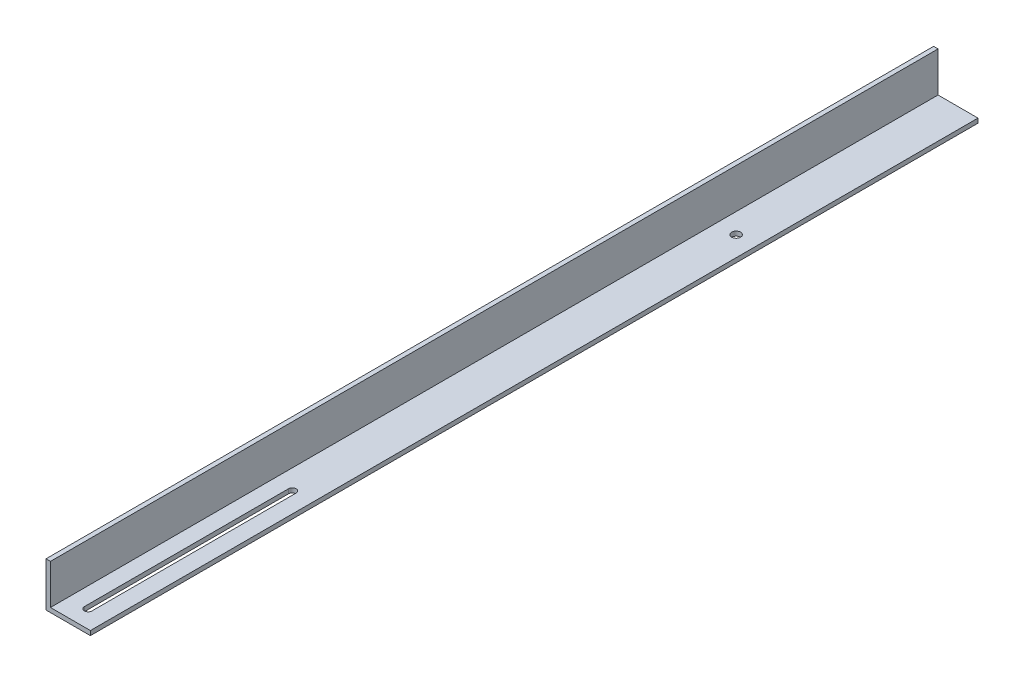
ISO-10303-21;
HEADER;
FILE_DESCRIPTION(('STEP AP214'),'2;1');
FILE_NAME('part.step','',(''),(''),'','','');
FILE_SCHEMA(('AUTOMOTIVE_DESIGN { 1 0 10303 214 1 1 1 1 }'));
ENDSEC;
DATA;
#1=APPLICATION_CONTEXT('core data for automotive mechanical design processes');
#2=APPLICATION_PROTOCOL_DEFINITION('international standard','automotive_design',2000,#1);
#3=PRODUCT_CONTEXT('',#1,'mechanical');
#4=PRODUCT('Part','Part','',(#3));
#5=PRODUCT_RELATED_PRODUCT_CATEGORY('part','',(#4));
#6=PRODUCT_DEFINITION_FORMATION('','',#4);
#7=PRODUCT_DEFINITION_CONTEXT('part definition',#1,'design');
#8=PRODUCT_DEFINITION('design','',#6,#7);
#9=PRODUCT_DEFINITION_SHAPE('','',#8);
#10=(LENGTH_UNIT() NAMED_UNIT(*) SI_UNIT(.MILLI.,.METRE.));
#11=(NAMED_UNIT(*) PLANE_ANGLE_UNIT() SI_UNIT($,.RADIAN.));
#12=(NAMED_UNIT(*) SI_UNIT($,.STERADIAN.) SOLID_ANGLE_UNIT());
#13=UNCERTAINTY_MEASURE_WITH_UNIT(LENGTH_MEASURE(1.E-05),#10,'distance_accuracy_value','');
#14=(GEOMETRIC_REPRESENTATION_CONTEXT(3) GLOBAL_UNCERTAINTY_ASSIGNED_CONTEXT((#13)) GLOBAL_UNIT_ASSIGNED_CONTEXT((#10,
#11,#12)) REPRESENTATION_CONTEXT('',''));
#15=CARTESIAN_POINT('',(0.,0.,0.));
#16=DIRECTION('',(0.,0.,1.));
#17=DIRECTION('',(1.,0.,0.));
#18=AXIS2_PLACEMENT_3D('',#15,#16,#17);
#19=CARTESIAN_POINT('',(50.,0.,-1000.));
#20=DIRECTION('',(0.,-1.,0.));
#21=DIRECTION('',(1.,0.,0.));
#22=AXIS2_PLACEMENT_3D('',#19,#20,#21);
#23=PLANE('',#22);
#24=CARTESIAN_POINT('',(27.5,0.,-20.));
#25=DIRECTION('',(0.,-1.,0.));
#26=DIRECTION('',(1.,0.,0.));
#27=AXIS2_PLACEMENT_3D('',#24,#25,#26);
#28=CIRCLE('',#27,4.25);
#29=CARTESIAN_POINT('',(23.25,0.,-20.));
#30=VERTEX_POINT('',#29);
#31=CARTESIAN_POINT('',(31.75,0.,-20.));
#32=VERTEX_POINT('',#31);
#33=EDGE_CURVE('E117',#30,#32,#28,.F.);
#34=ORIENTED_EDGE('',*,*,#33,.T.);
#35=DIRECTION('',(0.,0.,-1.));
#36=VECTOR('',#35,1.);
#37=CARTESIAN_POINT('',(31.75,0.,-20.));
#38=LINE('',#37,#36);
#39=CARTESIAN_POINT('',(31.75,0.,-250.));
#40=VERTEX_POINT('',#39);
#41=EDGE_CURVE('E106',#32,#40,#38,.T.);
#42=ORIENTED_EDGE('',*,*,#41,.T.);
#43=CARTESIAN_POINT('',(27.5,0.,-250.));
#44=DIRECTION('',(0.,-1.,0.));
#45=DIRECTION('',(1.,0.,0.));
#46=AXIS2_PLACEMENT_3D('',#43,#44,#45);
#47=CIRCLE('',#46,4.25);
#48=CARTESIAN_POINT('',(23.25,0.,-250.));
#49=VERTEX_POINT('',#48);
#50=EDGE_CURVE('E127',#40,#49,#47,.F.);
#51=ORIENTED_EDGE('',*,*,#50,.T.);
#52=DIRECTION('',(0.,0.,1.));
#53=VECTOR('',#52,1.);
#54=CARTESIAN_POINT('',(23.25,0.,-20.));
#55=LINE('',#54,#53);
#56=EDGE_CURVE('E123',#49,#30,#55,.T.);
#57=ORIENTED_EDGE('',*,*,#56,.T.);
#58=EDGE_LOOP('',(#34,#42,#51,#57));
#59=FACE_BOUND('',#58,.T.);
#60=CARTESIAN_POINT('',(27.5,0.,-750.));
#61=DIRECTION('',(0.,1.,0.));
#62=DIRECTION('',(0.,0.,1.));
#63=AXIS2_PLACEMENT_3D('',#60,#61,#62);
#64=CIRCLE('',#63,5.);
#65=CARTESIAN_POINT('',(27.5,0.,-745.));
#66=VERTEX_POINT('',#65);
#67=EDGE_CURVE('E143',#66,#66,#64,.T.);
#68=ORIENTED_EDGE('',*,*,#67,.T.);
#69=EDGE_LOOP('',(#68));
#70=FACE_BOUND('',#69,.T.);
#71=DIRECTION('',(1.,0.,0.));
#72=VECTOR('',#71,1.);
#73=CARTESIAN_POINT('',(50.,0.,0.));
#74=LINE('',#73,#72);
#75=CARTESIAN_POINT('',(0.,0.,0.));
#76=VERTEX_POINT('',#75);
#77=CARTESIAN_POINT('',(50.,0.,0.));
#78=VERTEX_POINT('',#77);
#79=EDGE_CURVE('E146',#76,#78,#74,.T.);
#80=ORIENTED_EDGE('',*,*,#79,.F.);
#81=DIRECTION('',(0.,0.,1.));
#82=VECTOR('',#81,1.);
#83=CARTESIAN_POINT('',(0.,0.,-1000.));
#84=LINE('',#83,#82);
#85=CARTESIAN_POINT('',(0.,0.,-1000.));
#86=VERTEX_POINT('',#85);
#87=EDGE_CURVE('E11',#86,#76,#84,.T.);
#88=ORIENTED_EDGE('',*,*,#87,.F.);
#89=DIRECTION('',(1.,0.,0.));
#90=VECTOR('',#89,1.);
#91=CARTESIAN_POINT('',(50.,0.,-1000.));
#92=LINE('',#91,#90);
#93=CARTESIAN_POINT('',(50.,0.,-1000.));
#94=VERTEX_POINT('',#93);
#95=EDGE_CURVE('E147',#86,#94,#92,.T.);
#96=ORIENTED_EDGE('',*,*,#95,.T.);
#97=DIRECTION('',(0.,0.,1.));
#98=VECTOR('',#97,1.);
#99=CARTESIAN_POINT('',(50.,0.,-1000.));
#100=LINE('',#99,#98);
#101=EDGE_CURVE('E33',#94,#78,#100,.T.);
#102=ORIENTED_EDGE('',*,*,#101,.T.);
#103=EDGE_LOOP('',(#80,#88,#96,#102));
#104=FACE_BOUND('',#103,.T.);
#105=ADVANCED_FACE('F30',(#59,#70,#104),#23,.T.);
#106=CARTESIAN_POINT('',(0.,0.,-1000.));
#107=DIRECTION('',(-1.,0.,0.));
#108=DIRECTION('',(0.,0.,1.));
#109=AXIS2_PLACEMENT_3D('',#106,#107,#108);
#110=PLANE('',#109);
#111=DIRECTION('',(0.,-1.,0.));
#112=VECTOR('',#111,1.);
#113=CARTESIAN_POINT('',(0.,0.,0.));
#114=LINE('',#113,#112);
#115=CARTESIAN_POINT('',(0.,50.,0.));
#116=VERTEX_POINT('',#115);
#117=EDGE_CURVE('E151',#116,#76,#114,.T.);
#118=ORIENTED_EDGE('',*,*,#117,.F.);
#119=DIRECTION('',(0.,0.,1.));
#120=VECTOR('',#119,1.);
#121=CARTESIAN_POINT('',(0.,50.,-1000.));
#122=LINE('',#121,#120);
#123=CARTESIAN_POINT('',(0.,50.,-1000.));
#124=VERTEX_POINT('',#123);
#125=EDGE_CURVE('E38',#124,#116,#122,.T.);
#126=ORIENTED_EDGE('',*,*,#125,.F.);
#127=DIRECTION('',(0.,-1.,0.));
#128=VECTOR('',#127,1.);
#129=CARTESIAN_POINT('',(0.,0.,-1000.));
#130=LINE('',#129,#128);
#131=EDGE_CURVE('E163',#124,#86,#130,.T.);
#132=ORIENTED_EDGE('',*,*,#131,.T.);
#133=ORIENTED_EDGE('',*,*,#87,.T.);
#134=EDGE_LOOP('',(#118,#126,#132,#133));
#135=FACE_BOUND('',#134,.T.);
#136=ADVANCED_FACE('F200',(#135),#110,.T.);
#137=CARTESIAN_POINT('',(0.,50.,-1000.));
#138=DIRECTION('',(0.,1.,0.));
#139=DIRECTION('',(0.,0.,1.));
#140=AXIS2_PLACEMENT_3D('',#137,#138,#139);
#141=PLANE('',#140);
#142=DIRECTION('',(-1.,0.,0.));
#143=VECTOR('',#142,1.);
#144=CARTESIAN_POINT('',(0.,50.,0.));
#145=LINE('',#144,#143);
#146=CARTESIAN_POINT('',(5.,50.,0.));
#147=VERTEX_POINT('',#146);
#148=EDGE_CURVE('E177',#147,#116,#145,.T.);
#149=ORIENTED_EDGE('',*,*,#148,.F.);
#150=DIRECTION('',(0.,0.,1.));
#151=VECTOR('',#150,1.);
#152=CARTESIAN_POINT('',(5.,50.,-1000.));
#153=LINE('',#152,#151);
#154=CARTESIAN_POINT('',(5.,50.,-1000.));
#155=VERTEX_POINT('',#154);
#156=EDGE_CURVE('E183',#155,#147,#153,.T.);
#157=ORIENTED_EDGE('',*,*,#156,.F.);
#158=DIRECTION('',(-1.,0.,0.));
#159=VECTOR('',#158,1.);
#160=CARTESIAN_POINT('',(0.,50.,-1000.));
#161=LINE('',#160,#159);
#162=EDGE_CURVE('E160',#155,#124,#161,.T.);
#163=ORIENTED_EDGE('',*,*,#162,.T.);
#164=ORIENTED_EDGE('',*,*,#125,.T.);
#165=EDGE_LOOP('',(#149,#157,#163,#164));
#166=FACE_BOUND('',#165,.T.);
#167=ADVANCED_FACE('F213',(#166),#141,.T.);
#168=CARTESIAN_POINT('',(5.,50.,-1000.));
#169=DIRECTION('',(1.,0.,0.));
#170=DIRECTION('',(0.,0.,-1.));
#171=AXIS2_PLACEMENT_3D('',#168,#169,#170);
#172=PLANE('',#171);
#173=DIRECTION('',(0.,1.,0.));
#174=VECTOR('',#173,1.);
#175=CARTESIAN_POINT('',(5.,50.,0.));
#176=LINE('',#175,#174);
#177=CARTESIAN_POINT('',(5.,5.,0.));
#178=VERTEX_POINT('',#177);
#179=EDGE_CURVE('E174',#178,#147,#176,.T.);
#180=ORIENTED_EDGE('',*,*,#179,.F.);
#181=DIRECTION('',(0.,0.,1.));
#182=VECTOR('',#181,1.);
#183=CARTESIAN_POINT('',(5.,5.,-1000.));
#184=LINE('',#183,#182);
#185=CARTESIAN_POINT('',(5.,5.,-1000.));
#186=VERTEX_POINT('',#185);
#187=EDGE_CURVE('E185',#186,#178,#184,.T.);
#188=ORIENTED_EDGE('',*,*,#187,.F.);
#189=DIRECTION('',(0.,1.,0.));
#190=VECTOR('',#189,1.);
#191=CARTESIAN_POINT('',(5.,50.,-1000.));
#192=LINE('',#191,#190);
#193=EDGE_CURVE('E157',#186,#155,#192,.T.);
#194=ORIENTED_EDGE('',*,*,#193,.T.);
#195=ORIENTED_EDGE('',*,*,#156,.T.);
#196=EDGE_LOOP('',(#180,#188,#194,#195));
#197=FACE_BOUND('',#196,.T.);
#198=ADVANCED_FACE('F211',(#197),#172,.T.);
#199=CARTESIAN_POINT('',(5.,5.,-1000.));
#200=DIRECTION('',(0.,1.,0.));
#201=DIRECTION('',(-1.,0.,0.));
#202=AXIS2_PLACEMENT_3D('',#199,#200,#201);
#203=PLANE('',#202);
#204=CARTESIAN_POINT('',(27.5,5.,-20.));
#205=DIRECTION('',(0.,1.,0.));
#206=DIRECTION('',(-1.,0.,0.));
#207=AXIS2_PLACEMENT_3D('',#204,#205,#206);
#208=CIRCLE('',#207,4.25);
#209=CARTESIAN_POINT('',(23.25,5.,-20.));
#210=VERTEX_POINT('',#209);
#211=CARTESIAN_POINT('',(31.75,5.,-20.));
#212=VERTEX_POINT('',#211);
#213=EDGE_CURVE('E54',#210,#212,#208,.T.);
#214=ORIENTED_EDGE('',*,*,#213,.F.);
#215=DIRECTION('',(0.,0.,1.));
#216=VECTOR('',#215,1.);
#217=CARTESIAN_POINT('',(23.25,5.,-20.));
#218=LINE('',#217,#216);
#219=CARTESIAN_POINT('',(23.25,5.,-250.));
#220=VERTEX_POINT('',#219);
#221=EDGE_CURVE('E119',#220,#210,#218,.T.);
#222=ORIENTED_EDGE('',*,*,#221,.F.);
#223=CARTESIAN_POINT('',(27.5,5.,-250.));
#224=DIRECTION('',(0.,1.,0.));
#225=DIRECTION('',(-1.,0.,0.));
#226=AXIS2_PLACEMENT_3D('',#223,#224,#225);
#227=CIRCLE('',#226,4.25);
#228=CARTESIAN_POINT('',(31.75,5.,-250.));
#229=VERTEX_POINT('',#228);
#230=EDGE_CURVE('E132',#229,#220,#227,.T.);
#231=ORIENTED_EDGE('',*,*,#230,.F.);
#232=DIRECTION('',(0.,0.,-1.));
#233=VECTOR('',#232,1.);
#234=CARTESIAN_POINT('',(31.75,5.,-20.));
#235=LINE('',#234,#233);
#236=EDGE_CURVE('E125',#212,#229,#235,.T.);
#237=ORIENTED_EDGE('',*,*,#236,.F.);
#238=EDGE_LOOP('',(#214,#222,#231,#237));
#239=FACE_BOUND('',#238,.T.);
#240=CARTESIAN_POINT('',(27.5,5.,-750.));
#241=DIRECTION('',(0.,1.,0.));
#242=DIRECTION('',(0.,0.,1.));
#243=AXIS2_PLACEMENT_3D('',#240,#241,#242);
#244=CIRCLE('',#243,4.99999999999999);
#245=CARTESIAN_POINT('',(27.5,5.,-745.));
#246=VERTEX_POINT('',#245);
#247=EDGE_CURVE('E113',#246,#246,#244,.T.);
#248=ORIENTED_EDGE('',*,*,#247,.F.);
#249=EDGE_LOOP('',(#248));
#250=FACE_BOUND('',#249,.T.);
#251=DIRECTION('',(-1.,0.,0.));
#252=VECTOR('',#251,1.);
#253=CARTESIAN_POINT('',(5.,5.,0.));
#254=LINE('',#253,#252);
#255=CARTESIAN_POINT('',(50.,5.,0.));
#256=VERTEX_POINT('',#255);
#257=EDGE_CURVE('E171',#256,#178,#254,.T.);
#258=ORIENTED_EDGE('',*,*,#257,.F.);
#259=DIRECTION('',(0.,0.,1.));
#260=VECTOR('',#259,1.);
#261=CARTESIAN_POINT('',(50.,5.,-1000.));
#262=LINE('',#261,#260);
#263=CARTESIAN_POINT('',(50.,5.,-1000.));
#264=VERTEX_POINT('',#263);
#265=EDGE_CURVE('E186',#264,#256,#262,.T.);
#266=ORIENTED_EDGE('',*,*,#265,.F.);
#267=DIRECTION('',(-1.,0.,0.));
#268=VECTOR('',#267,1.);
#269=CARTESIAN_POINT('',(5.,5.,-1000.));
#270=LINE('',#269,#268);
#271=EDGE_CURVE('E154',#264,#186,#270,.T.);
#272=ORIENTED_EDGE('',*,*,#271,.T.);
#273=ORIENTED_EDGE('',*,*,#187,.T.);
#274=EDGE_LOOP('',(#258,#266,#272,#273));
#275=FACE_BOUND('',#274,.T.);
#276=ADVANCED_FACE('F208',(#239,#250,#275),#203,.T.);
#277=CARTESIAN_POINT('',(50.,5.,-1000.));
#278=DIRECTION('',(1.,0.,0.));
#279=DIRECTION('',(0.,0.,-1.));
#280=AXIS2_PLACEMENT_3D('',#277,#278,#279);
#281=PLANE('',#280);
#282=DIRECTION('',(0.,1.,0.));
#283=VECTOR('',#282,1.);
#284=CARTESIAN_POINT('',(50.,5.,0.));
#285=LINE('',#284,#283);
#286=EDGE_CURVE('E168',#78,#256,#285,.T.);
#287=ORIENTED_EDGE('',*,*,#286,.F.);
#288=ORIENTED_EDGE('',*,*,#101,.F.);
#289=DIRECTION('',(0.,1.,0.));
#290=VECTOR('',#289,1.);
#291=CARTESIAN_POINT('',(50.,5.,-1000.));
#292=LINE('',#291,#290);
#293=EDGE_CURVE('E150',#94,#264,#292,.T.);
#294=ORIENTED_EDGE('',*,*,#293,.T.);
#295=ORIENTED_EDGE('',*,*,#265,.T.);
#296=EDGE_LOOP('',(#287,#288,#294,#295));
#297=FACE_BOUND('',#296,.T.);
#298=ADVANCED_FACE('F194',(#297),#281,.T.);
#299=CARTESIAN_POINT('',(0.,0.,-1000.));
#300=DIRECTION('',(0.,0.,-1.));
#301=DIRECTION('',(-1.,0.,0.));
#302=AXIS2_PLACEMENT_3D('',#299,#300,#301);
#303=PLANE('',#302);
#304=ORIENTED_EDGE('',*,*,#95,.F.);
#305=ORIENTED_EDGE('',*,*,#131,.F.);
#306=ORIENTED_EDGE('',*,*,#162,.F.);
#307=ORIENTED_EDGE('',*,*,#193,.F.);
#308=ORIENTED_EDGE('',*,*,#271,.F.);
#309=ORIENTED_EDGE('',*,*,#293,.F.);
#310=EDGE_LOOP('',(#304,#305,#306,#307,#308,#309));
#311=FACE_BOUND('',#310,.T.);
#312=ADVANCED_FACE('F203',(#311),#303,.T.);
#313=CARTESIAN_POINT('',(0.,0.,0.));
#314=DIRECTION('',(0.,0.,-1.));
#315=DIRECTION('',(-1.,0.,0.));
#316=AXIS2_PLACEMENT_3D('',#313,#314,#315);
#317=PLANE('',#316);
#318=ORIENTED_EDGE('',*,*,#79,.T.);
#319=ORIENTED_EDGE('',*,*,#286,.T.);
#320=ORIENTED_EDGE('',*,*,#257,.T.);
#321=ORIENTED_EDGE('',*,*,#179,.T.);
#322=ORIENTED_EDGE('',*,*,#148,.T.);
#323=ORIENTED_EDGE('',*,*,#117,.T.);
#324=EDGE_LOOP('',(#318,#319,#320,#321,#322,#323));
#325=FACE_BOUND('',#324,.T.);
#326=ADVANCED_FACE('F196',(#325),#317,.F.);
#327=CARTESIAN_POINT('',(27.5,5.,-750.));
#328=DIRECTION('',(0.,1.,0.));
#329=DIRECTION('',(0.,0.,1.));
#330=AXIS2_PLACEMENT_3D('',#327,#328,#329);
#331=CYLINDRICAL_SURFACE('',#330,4.99999999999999);
#332=ORIENTED_EDGE('',*,*,#67,.F.);
#333=EDGE_LOOP('',(#332));
#334=FACE_BOUND('',#333,.T.);
#335=ORIENTED_EDGE('',*,*,#247,.T.);
#336=EDGE_LOOP('',(#335));
#337=FACE_BOUND('',#336,.T.);
#338=ADVANCED_FACE('F266',(#334,#337),#331,.F.);
#339=CARTESIAN_POINT('',(27.5,-0.0010000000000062,-20.));
#340=DIRECTION('',(0.,1.,0.));
#341=DIRECTION('',(-1.,0.,0.));
#342=AXIS2_PLACEMENT_3D('',#339,#340,#341);
#343=CYLINDRICAL_SURFACE('',#342,4.25);
#344=DIRECTION('',(0.,1.,0.));
#345=VECTOR('',#344,1.);
#346=CARTESIAN_POINT('',(23.25,-0.0010000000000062,-20.));
#347=LINE('',#346,#345);
#348=EDGE_CURVE('E114',#30,#210,#347,.T.);
#349=ORIENTED_EDGE('',*,*,#348,.T.);
#350=ORIENTED_EDGE('',*,*,#213,.T.);
#351=DIRECTION('',(0.,1.,0.));
#352=VECTOR('',#351,1.);
#353=CARTESIAN_POINT('',(31.75,-0.0010000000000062,-20.));
#354=LINE('',#353,#352);
#355=EDGE_CURVE('E108',#32,#212,#354,.T.);
#356=ORIENTED_EDGE('',*,*,#355,.F.);
#357=ORIENTED_EDGE('',*,*,#33,.F.);
#358=EDGE_LOOP('',(#349,#350,#356,#357));
#359=FACE_BOUND('',#358,.T.);
#360=ADVANCED_FACE('F116',(#359),#343,.F.);
#361=CARTESIAN_POINT('',(23.25,-0.0010000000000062,-20.));
#362=DIRECTION('',(-1.,0.,0.));
#363=DIRECTION('',(0.,-1.,0.));
#364=AXIS2_PLACEMENT_3D('',#361,#362,#363);
#365=PLANE('',#364);
#366=DIRECTION('',(0.,1.,0.));
#367=VECTOR('',#366,1.);
#368=CARTESIAN_POINT('',(23.25,-0.0010000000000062,-250.));
#369=LINE('',#368,#367);
#370=EDGE_CURVE('E138',#49,#220,#369,.T.);
#371=ORIENTED_EDGE('',*,*,#370,.T.);
#372=ORIENTED_EDGE('',*,*,#221,.T.);
#373=ORIENTED_EDGE('',*,*,#348,.F.);
#374=ORIENTED_EDGE('',*,*,#56,.F.);
#375=EDGE_LOOP('',(#371,#372,#373,#374));
#376=FACE_BOUND('',#375,.T.);
#377=ADVANCED_FACE('F284',(#376),#365,.F.);
#378=CARTESIAN_POINT('',(27.5,-0.0010000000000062,-250.));
#379=DIRECTION('',(0.,1.,0.));
#380=DIRECTION('',(-1.,0.,0.));
#381=AXIS2_PLACEMENT_3D('',#378,#379,#380);
#382=CYLINDRICAL_SURFACE('',#381,4.25);
#383=DIRECTION('',(0.,1.,0.));
#384=VECTOR('',#383,1.);
#385=CARTESIAN_POINT('',(31.75,-0.0010000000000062,-250.));
#386=LINE('',#385,#384);
#387=EDGE_CURVE('E46',#40,#229,#386,.T.);
#388=ORIENTED_EDGE('',*,*,#387,.T.);
#389=ORIENTED_EDGE('',*,*,#230,.T.);
#390=ORIENTED_EDGE('',*,*,#370,.F.);
#391=ORIENTED_EDGE('',*,*,#50,.F.);
#392=EDGE_LOOP('',(#388,#389,#390,#391));
#393=FACE_BOUND('',#392,.T.);
#394=ADVANCED_FACE('F290',(#393),#382,.F.);
#395=CARTESIAN_POINT('',(31.75,-0.0010000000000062,-20.));
#396=DIRECTION('',(1.,0.,0.));
#397=DIRECTION('',(0.,1.,0.));
#398=AXIS2_PLACEMENT_3D('',#395,#396,#397);
#399=PLANE('',#398);
#400=ORIENTED_EDGE('',*,*,#355,.T.);
#401=ORIENTED_EDGE('',*,*,#236,.T.);
#402=ORIENTED_EDGE('',*,*,#387,.F.);
#403=ORIENTED_EDGE('',*,*,#41,.F.);
#404=EDGE_LOOP('',(#400,#401,#402,#403));
#405=FACE_BOUND('',#404,.T.);
#406=ADVANCED_FACE('F107',(#405),#399,.F.);
#407=CLOSED_SHELL('',(#105,#136,#167,#198,#276,#298,#312,#326,#338,#360,#377,#394,#406));
#408=MANIFOLD_SOLID_BREP('B2',#407);
#409=ADVANCED_BREP_SHAPE_REPRESENTATION('',(#18,#408),#14);
#410=SHAPE_DEFINITION_REPRESENTATION(#9,#409);
ENDSEC;
END-ISO-10303-21;
